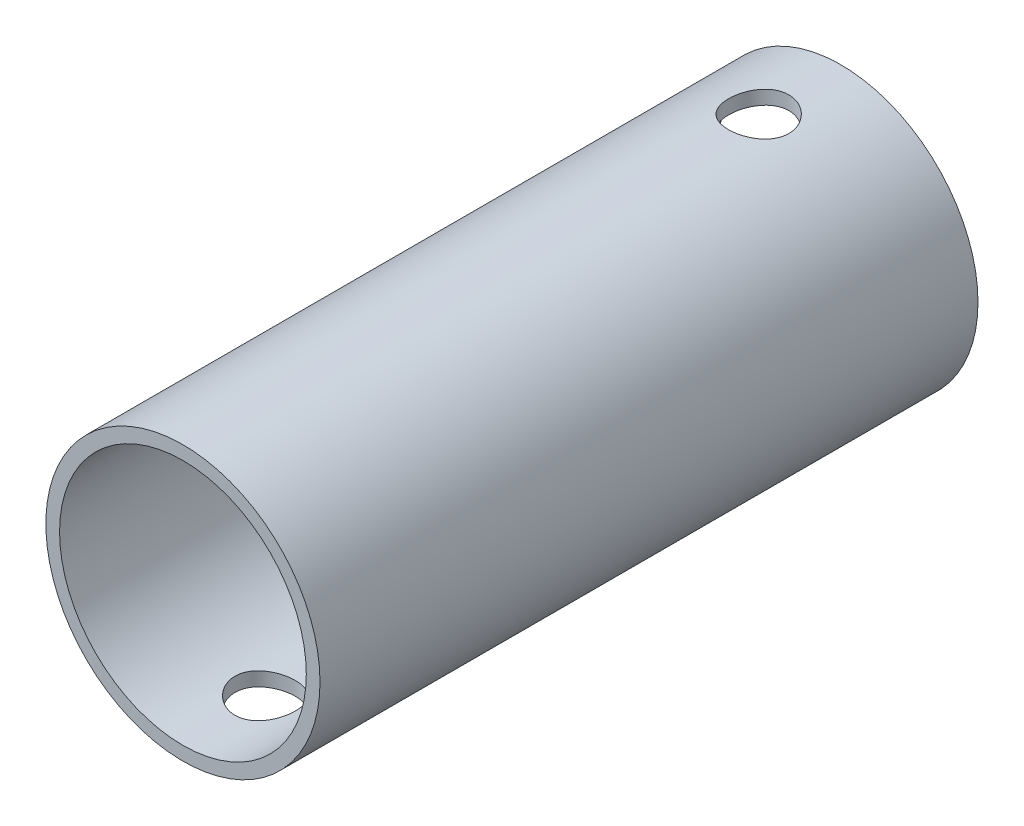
ISO-10303-21;
HEADER;
FILE_DESCRIPTION(('STEP AP214'),'2;1');
FILE_NAME('part.step','',(''),(''),'','','');
FILE_SCHEMA(('AUTOMOTIVE_DESIGN { 1 0 10303 214 1 1 1 1 }'));
ENDSEC;
DATA;
#1=APPLICATION_CONTEXT('core data for automotive mechanical design processes');
#2=APPLICATION_PROTOCOL_DEFINITION('international standard','automotive_design',2000,#1);
#3=PRODUCT_CONTEXT('',#1,'mechanical');
#4=PRODUCT('Part','Part','',(#3));
#5=PRODUCT_RELATED_PRODUCT_CATEGORY('part','',(#4));
#6=PRODUCT_DEFINITION_FORMATION('','',#4);
#7=PRODUCT_DEFINITION_CONTEXT('part definition',#1,'design');
#8=PRODUCT_DEFINITION('design','',#6,#7);
#9=PRODUCT_DEFINITION_SHAPE('','',#8);
#10=(LENGTH_UNIT() NAMED_UNIT(*) SI_UNIT(.MILLI.,.METRE.));
#11=(NAMED_UNIT(*) PLANE_ANGLE_UNIT() SI_UNIT($,.RADIAN.));
#12=(NAMED_UNIT(*) SI_UNIT($,.STERADIAN.) SOLID_ANGLE_UNIT());
#13=UNCERTAINTY_MEASURE_WITH_UNIT(LENGTH_MEASURE(1.E-05),#10,'distance_accuracy_value','');
#14=(GEOMETRIC_REPRESENTATION_CONTEXT(3) GLOBAL_UNCERTAINTY_ASSIGNED_CONTEXT((#13)) GLOBAL_UNIT_ASSIGNED_CONTEXT((#10,
#11,#12)) REPRESENTATION_CONTEXT('',''));
#15=CARTESIAN_POINT('',(0.,0.,0.));
#16=DIRECTION('',(0.,0.,1.));
#17=DIRECTION('',(1.,0.,0.));
#18=AXIS2_PLACEMENT_3D('',#15,#16,#17);
#19=CARTESIAN_POINT('',(0.,0.,1200.));
#20=DIRECTION('',(0.,0.,-1.));
#21=DIRECTION('',(-1.,0.,0.));
#22=AXIS2_PLACEMENT_3D('',#19,#20,#21);
#23=CYLINDRICAL_SURFACE('',#22,250.);
#24=CARTESIAN_POINT('',(0.,-250.,1105.));
#25=CARTESIAN_POINT('',(1.52516091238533,-249.99999609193,1104.99999226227));
#26=CARTESIAN_POINT('',(3.05048919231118,-249.986007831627,1104.93650652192));
#27=CARTESIAN_POINT('',(6.09022569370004,-249.93043251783,1104.68305072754));
#28=CARTESIAN_POINT('',(7.60463225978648,-249.888841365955,1104.49306189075));
#29=CARTESIAN_POINT('',(10.612476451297,-249.779185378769,1103.98798231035));
#30=CARTESIAN_POINT('',(12.105900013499,-249.711103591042,1103.67281145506));
#31=CARTESIAN_POINT('',(15.0600950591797,-249.55035968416,1102.91991208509));
#32=CARTESIAN_POINT('',(16.5208676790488,-249.457698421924,1102.48218784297));
#33=CARTESIAN_POINT('',(19.3981221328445,-249.250458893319,1101.48812606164));
#34=CARTESIAN_POINT('',(20.8146491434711,-249.1359038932,1100.93191436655));
#35=CARTESIAN_POINT('',(23.5953978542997,-248.887938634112,1099.7047972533));
#36=CARTESIAN_POINT('',(24.9596191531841,-248.754528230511,1099.03389095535));
#37=CARTESIAN_POINT('',(27.6265956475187,-248.472472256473,1097.58230858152));
#38=CARTESIAN_POINT('',(28.9293539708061,-248.323827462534,1096.80163809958));
#39=CARTESIAN_POINT('',(31.4649695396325,-248.015296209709,1095.13598035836));
#40=CARTESIAN_POINT('',(32.6978260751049,-247.855409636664,1094.25099203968));
#41=CARTESIAN_POINT('',(35.1030445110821,-247.526304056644,1092.36911205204));
#42=CARTESIAN_POINT('',(36.2742656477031,-247.356983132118,1091.37077992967));
#43=CARTESIAN_POINT('',(38.5287872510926,-247.015855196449,1089.27972085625));
#44=CARTESIAN_POINT('',(39.6120868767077,-246.844048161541,1088.18699300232));
#45=CARTESIAN_POINT('',(41.6836152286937,-246.502694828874,1085.91434854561));
#46=CARTESIAN_POINT('',(42.6718357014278,-246.333148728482,1084.73442438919));
#47=CARTESIAN_POINT('',(44.5463780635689,-246.001070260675,1082.29529430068));
#48=CARTESIAN_POINT('',(45.4326995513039,-245.838537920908,1081.03608805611));
#49=CARTESIAN_POINT('',(47.1065974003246,-245.523323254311,1078.43221287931));
#50=CARTESIAN_POINT('',(47.8929537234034,-245.370771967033,1077.08674331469));
#51=CARTESIAN_POINT('',(49.349313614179,-245.082020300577,1074.3325278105));
#52=CARTESIAN_POINT('',(50.0193160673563,-244.945820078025,1072.92378126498));
#53=CARTESIAN_POINT('',(51.237750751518,-244.693849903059,1070.05303131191));
#54=CARTESIAN_POINT('',(51.7861944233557,-244.578078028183,1068.59103293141));
#55=CARTESIAN_POINT('',(52.757196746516,-244.370466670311,1065.6241590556));
#56=CARTESIAN_POINT('',(53.1797576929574,-244.278626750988,1064.11928434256));
#57=CARTESIAN_POINT('',(53.889872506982,-244.122944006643,1061.10163736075));
#58=CARTESIAN_POINT('',(54.1794454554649,-244.058683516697,1059.5893616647));
#59=CARTESIAN_POINT('',(54.6308674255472,-243.958033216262,1056.54494373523));
#60=CARTESIAN_POINT('',(54.7927176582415,-243.9216431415,1055.01280169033));
#61=CARTESIAN_POINT('',(54.9873225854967,-243.877847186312,1051.94009440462));
#62=CARTESIAN_POINT('',(55.0200913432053,-243.870438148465,1050.39953009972));
#63=CARTESIAN_POINT('',(54.9562927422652,-243.884823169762,1047.32122803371));
#64=CARTESIAN_POINT('',(54.8597267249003,-243.906616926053,1045.78349024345));
#65=CARTESIAN_POINT('',(54.541056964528,-243.978070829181,1042.75050208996));
#66=CARTESIAN_POINT('',(54.3213050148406,-244.027208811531,1041.25499158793));
#67=CARTESIAN_POINT('',(53.7597689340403,-244.15153043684,1038.28818915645));
#68=CARTESIAN_POINT('',(53.4179865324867,-244.226713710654,1036.81689688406));
#69=CARTESIAN_POINT('',(52.6150593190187,-244.400949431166,1033.90865713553));
#70=CARTESIAN_POINT('',(52.1539098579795,-244.50000280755,1032.47171099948));
#71=CARTESIAN_POINT('',(51.1157643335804,-244.7191448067,1029.64195383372));
#72=CARTESIAN_POINT('',(50.5387668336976,-244.839233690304,1028.24914335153));
#73=CARTESIAN_POINT('',(49.2680803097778,-245.098102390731,1025.50592817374));
#74=CARTESIAN_POINT('',(48.5734914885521,-245.23702454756,1024.15595378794));
#75=CARTESIAN_POINT('',(47.0758998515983,-245.528901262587,1021.51915379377));
#76=CARTESIAN_POINT('',(46.272896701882,-245.681855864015,1020.23232837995));
#77=CARTESIAN_POINT('',(44.5639383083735,-245.997581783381,1017.73002655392));
#78=CARTESIAN_POINT('',(43.6579711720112,-246.160354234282,1016.51455840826));
#79=CARTESIAN_POINT('',(41.7492344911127,-246.491256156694,1014.16294004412));
#80=CARTESIAN_POINT('',(40.7464635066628,-246.659385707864,1013.02679100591));
#81=CARTESIAN_POINT('',(38.6277126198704,-247.000153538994,1010.81717666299));
#82=CARTESIAN_POINT('',(37.5097339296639,-247.172809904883,1009.74562977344));
#83=CARTESIAN_POINT('',(35.1870718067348,-247.514135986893,1007.70030045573));
#84=CARTESIAN_POINT('',(33.9823870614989,-247.682805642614,1006.72651950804));
#85=CARTESIAN_POINT('',(31.4943766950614,-248.011448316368,1004.88347309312));
#86=CARTESIAN_POINT('',(30.2110490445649,-248.171421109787,1004.0142103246));
#87=CARTESIAN_POINT('',(27.5744613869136,-248.478188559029,1002.38645856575));
#88=CARTESIAN_POINT('',(26.2212017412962,-248.62498328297,1001.62796900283));
#89=CARTESIAN_POINT('',(23.4509729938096,-248.901573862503,1000.22583866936));
#90=CARTESIAN_POINT('',(22.0338702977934,-249.031331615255,999.582454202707));
#91=CARTESIAN_POINT('',(19.1486852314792,-249.269779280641,998.417559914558));
#92=CARTESIAN_POINT('',(17.6806026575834,-249.378469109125,997.896050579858));
#93=CARTESIAN_POINT('',(14.7041934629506,-249.571653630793,996.979142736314));
#94=CARTESIAN_POINT('',(13.1958716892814,-249.65615122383,996.583729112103));
#95=CARTESIAN_POINT('',(10.1499048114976,-249.798526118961,995.922202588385));
#96=CARTESIAN_POINT('',(8.61226025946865,-249.856403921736,995.656087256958));
#97=CARTESIAN_POINT('',(5.55022873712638,-249.942980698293,995.259427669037));
#98=CARTESIAN_POINT('',(4.02619618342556,-249.972242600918,995.126266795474));
#99=CARTESIAN_POINT('',(0.972063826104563,-250.002774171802,994.987349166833));
#100=CARTESIAN_POINT('',(-0.558035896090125,-250.004044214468,994.981590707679));
#101=CARTESIAN_POINT('',(-3.61306072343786,-249.978557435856,995.097519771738));
#102=CARTESIAN_POINT('',(-5.1379861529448,-249.951802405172,995.219199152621));
#103=CARTESIAN_POINT('',(-8.17169117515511,-249.871018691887,995.588985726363));
#104=CARTESIAN_POINT('',(-9.68047081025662,-249.816990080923,995.837092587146));
#105=CARTESIAN_POINT('',(-12.6543762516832,-249.683915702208,996.454249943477));
#106=CARTESIAN_POINT('',(-14.1198010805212,-249.605155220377,996.821922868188));
#107=CARTESIAN_POINT('',(-17.0141301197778,-249.424581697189,997.67604716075));
#108=CARTESIAN_POINT('',(-18.4430346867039,-249.322768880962,998.162497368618));
#109=CARTESIAN_POINT('',(-21.2547530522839,-249.098825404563,999.250536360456));
#110=CARTESIAN_POINT('',(-22.6375639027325,-248.976693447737,999.852132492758));
#111=CARTESIAN_POINT('',(-25.3478580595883,-248.715379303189,1001.16605463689));
#112=CARTESIAN_POINT('',(-26.6753405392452,-248.576196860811,1001.87838230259));
#113=CARTESIAN_POINT('',(-29.285029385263,-248.282371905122,1003.41978314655));
#114=CARTESIAN_POINT('',(-30.5663077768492,-248.127535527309,1004.25039059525));
#115=CARTESIAN_POINT('',(-33.0546278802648,-247.808323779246,1006.01457418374));
#116=CARTESIAN_POINT('',(-34.2616689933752,-247.643948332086,1006.94815115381));
#117=CARTESIAN_POINT('',(-36.5937774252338,-247.31009570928,1008.91205022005));
#118=CARTESIAN_POINT('',(-37.7188352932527,-247.14061794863,1009.94238343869));
#119=CARTESIAN_POINT('',(-39.8794835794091,-246.801181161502,1012.09287511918));
#120=CARTESIAN_POINT('',(-40.9150730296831,-246.631222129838,1013.2130345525));
#121=CARTESIAN_POINT('',(-42.9084034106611,-246.292326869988,1015.55757821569));
#122=CARTESIAN_POINT('',(-43.8643280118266,-246.123469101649,1016.78351889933));
#123=CARTESIAN_POINT('',(-45.6695317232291,-245.794906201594,1019.31274129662));
#124=CARTESIAN_POINT('',(-46.5188093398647,-245.635201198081,1020.61602409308));
#125=CARTESIAN_POINT('',(-48.1045501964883,-245.329583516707,1023.29101886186));
#126=CARTESIAN_POINT('',(-48.841016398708,-245.183670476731,1024.66272903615));
#127=CARTESIAN_POINT('',(-50.1956284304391,-244.909935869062,1027.46511850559));
#128=CARTESIAN_POINT('',(-50.8137756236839,-244.782114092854,1028.89579712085));
#129=CARTESIAN_POINT('',(-51.9237531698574,-244.54906229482,1031.79771159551));
#130=CARTESIAN_POINT('',(-52.4162854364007,-244.443707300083,1033.26866884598));
#131=CARTESIAN_POINT('',(-53.275677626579,-244.257846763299,1036.24840242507));
#132=CARTESIAN_POINT('',(-53.6425377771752,-244.177341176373,1037.75717868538));
#133=CARTESIAN_POINT('',(-54.2475075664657,-244.043651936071,1040.80131680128));
#134=CARTESIAN_POINT('',(-54.4856347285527,-243.990464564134,1042.3366750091));
#135=CARTESIAN_POINT('',(-54.8311902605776,-243.913042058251,1045.42274598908));
#136=CARTESIAN_POINT('',(-54.9386209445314,-243.888806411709,1046.97345848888));
#137=CARTESIAN_POINT('',(-55.0209493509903,-243.870245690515,1050.04424823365));
#138=CARTESIAN_POINT('',(-54.9987233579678,-243.875271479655,1051.56424520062));
#139=CARTESIAN_POINT('',(-54.828601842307,-243.913574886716,1054.59681309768));
#140=CARTESIAN_POINT('',(-54.6807082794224,-243.946852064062,1056.10938414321));
#141=CARTESIAN_POINT('',(-54.2604703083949,-244.04066786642,1059.11623925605));
#142=CARTESIAN_POINT('',(-53.9881281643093,-244.101205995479,1060.61052365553));
#143=CARTESIAN_POINT('',(-53.3211867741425,-244.24775829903,1063.57027301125));
#144=CARTESIAN_POINT('',(-52.926586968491,-244.333772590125,1065.03573783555));
#145=CARTESIAN_POINT('',(-52.0198553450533,-244.528420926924,1067.92248230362));
#146=CARTESIAN_POINT('',(-51.5081496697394,-244.636972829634,1069.34390143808));
#147=CARTESIAN_POINT('',(-50.370285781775,-244.873787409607,1072.13843685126));
#148=CARTESIAN_POINT('',(-49.7441281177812,-245.00204999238,1073.51155336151));
#149=CARTESIAN_POINT('',(-48.3818431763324,-245.274702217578,1076.20055540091));
#150=CARTESIAN_POINT('',(-47.6457070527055,-245.419093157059,1077.51643631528));
#151=CARTESIAN_POINT('',(-46.0686364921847,-245.720013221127,1080.08236414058));
#152=CARTESIAN_POINT('',(-45.227700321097,-245.876542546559,1081.3324099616));
#153=CARTESIAN_POINT('',(-43.4284745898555,-246.20077148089,1083.78351431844));
#154=CARTESIAN_POINT('',(-42.4681368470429,-246.368634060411,1084.98304830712));
#155=CARTESIAN_POINT('',(-40.4507782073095,-246.707884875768,1087.2973330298));
#156=CARTESIAN_POINT('',(-39.3937558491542,-246.879273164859,1088.41208248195));
#157=CARTESIAN_POINT('',(-37.1898441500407,-247.220870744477,1090.54963109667));
#158=CARTESIAN_POINT('',(-36.0429343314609,-247.39107975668,1091.57240919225));
#159=CARTESIAN_POINT('',(-33.6670613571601,-247.725589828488,1093.51881539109));
#160=CARTESIAN_POINT('',(-32.4380986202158,-247.889890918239,1094.44244400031));
#161=CARTESIAN_POINT('',(-29.8895536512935,-248.210163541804,1096.19565047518));
#162=CARTESIAN_POINT('',(-28.5689909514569,-248.365996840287,1097.02382914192));
#163=CARTESIAN_POINT('',(-25.8609666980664,-248.662553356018,1098.56581313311));
#164=CARTESIAN_POINT('',(-24.4735017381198,-248.803275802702,1099.27961262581));
#165=CARTESIAN_POINT('',(-21.6425238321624,-249.065494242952,1100.58685915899));
#166=CARTESIAN_POINT('',(-20.1990538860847,-249.187004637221,1101.1803964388));
#167=CARTESIAN_POINT('',(-17.265502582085,-249.407426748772,1102.24303905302));
#168=CARTESIAN_POINT('',(-15.7754295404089,-249.506342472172,1102.71216644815));
#169=CARTESIAN_POINT('',(-13.1072415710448,-249.65887224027,1103.4288733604));
#170=CARTESIAN_POINT('',(-11.9363665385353,-249.717672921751,1103.70259450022));
#171=CARTESIAN_POINT('',(-9.57823095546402,-249.819234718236,1104.17289898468));
#172=CARTESIAN_POINT('',(-8.39096716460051,-249.861992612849,1104.36946684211));
#173=CARTESIAN_POINT('',(-6.00566646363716,-249.930701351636,1104.68435904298));
#174=CARTESIAN_POINT('',(-4.80762993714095,-249.956652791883,1104.80268616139));
#175=CARTESIAN_POINT('',(-2.40642957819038,-249.991301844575,1104.96050140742));
#176=CARTESIAN_POINT('',(-1.20326687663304,-250.000003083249,1105.00000610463));
#177=CARTESIAN_POINT('',(0.,-250.,1105.));
#178=B_SPLINE_CURVE_WITH_KNOTS('',3,(#24,#25,#26,#27,#28,#29,#30,#31,#32,#33,#34,#35,#36,#37,
#38,#39,#40,#41,#42,#43,#44,#45,#46,#47,#48,#49,#50,#51,#52,#53,#54,#55,#56,#57,#58,#59,#60,#61,
#62,#63,#64,#65,#66,#67,#68,#69,#70,#71,#72,#73,#74,#75,#76,#77,#78,#79,#80,#81,#82,#83,#84,#85,
#86,#87,#88,#89,#90,#91,#92,#93,#94,#95,#96,#97,#98,#99,#100,#101,#102,#103,#104,#105,#106,#107,
#108,#109,#110,#111,#112,#113,#114,#115,#116,#117,#118,#119,#120,#121,#122,#123,#124,#125,#126,
#127,#128,#129,#130,#131,#132,#133,#134,#135,#136,#137,#138,#139,#140,#141,#142,#143,#144,#145,
#146,#147,#148,#149,#150,#151,#152,#153,#154,#155,#156,#157,#158,#159,#160,#161,#162,#163,#164,
#165,#166,#167,#168,#169,#170,#171,#172,#173,#174,#175,#176,#177),.UNSPECIFIED.,.T.,.F.,(4,2,2,
2,2,2,2,2,2,2,2,2,2,2,2,2,2,2,2,2,2,2,2,2,2,2,2,2,2,2,2,2,2,2,2,2,2,2,2,2,2,2,2,2,2,2,2,2,2,2,2,
2,2,2,2,2,2,2,2,2,2,2,2,2,2,2,2,2,2,2,2,2,2,2,2,2,4),(0.,4.57439193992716,9.14946322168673,
13.7274671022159,18.3053114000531,22.8783176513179,27.4513589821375,32.0241673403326,
36.5970221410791,41.2363914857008,45.8758052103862,50.5156213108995,55.1554557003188,
59.8473701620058,64.5393295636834,69.230847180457,73.9222792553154,78.5399160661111,
83.1575090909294,87.7745990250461,92.3916410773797,96.9234003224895,101.455095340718,
105.986966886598,110.518894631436,115.087212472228,119.655544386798,124.224404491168,
128.793332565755,133.462349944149,138.131438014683,142.80064661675,147.469831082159,
152.149286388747,156.828760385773,161.507673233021,166.186498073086,170.771310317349,
175.356061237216,179.940519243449,184.524965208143,189.058359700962,193.591709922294,
198.125349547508,202.659056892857,207.258089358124,211.85715890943,216.456757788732,
221.056406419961,225.742006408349,230.427672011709,235.113214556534,239.798703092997,
244.457406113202,249.116100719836,253.774161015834,258.432138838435,262.987183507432,
267.54215714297,272.097047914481,276.651959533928,281.190552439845,285.729123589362,
290.268059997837,294.807071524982,299.438905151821,304.070808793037,308.703770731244,
313.336709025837,318.03067674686,322.724883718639,327.41555521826,332.105394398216,
335.714497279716,339.324324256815,342.934023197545,346.542963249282),.UNSPECIFIED.);
#179=CARTESIAN_POINT('',(0.,-250.,1105.));
#180=VERTEX_POINT('',#179);
#181=EDGE_CURVE('E63',#180,#180,#178,.T.);
#182=ORIENTED_EDGE('',*,*,#181,.T.);
#183=EDGE_LOOP('',(#182));
#184=FACE_BOUND('',#183,.T.);
#185=CARTESIAN_POINT('',(0.,0.,1200.));
#186=DIRECTION('',(0.,0.,1.));
#187=DIRECTION('',(1.,0.,0.));
#188=AXIS2_PLACEMENT_3D('',#185,#186,#187);
#189=CIRCLE('',#188,250.);
#190=CARTESIAN_POINT('',(250.,0.,1200.));
#191=VERTEX_POINT('',#190);
#192=EDGE_CURVE('E10',#191,#191,#189,.T.);
#193=ORIENTED_EDGE('',*,*,#192,.F.);
#194=EDGE_LOOP('',(#193));
#195=FACE_BOUND('',#194,.T.);
#196=CARTESIAN_POINT('',(0.,0.,0.));
#197=DIRECTION('',(0.,0.,1.));
#198=DIRECTION('',(1.,0.,0.));
#199=AXIS2_PLACEMENT_3D('',#196,#197,#198);
#200=CIRCLE('',#199,250.);
#201=CARTESIAN_POINT('',(250.,0.,0.));
#202=VERTEX_POINT('',#201);
#203=EDGE_CURVE('E47',#202,#202,#200,.T.);
#204=ORIENTED_EDGE('',*,*,#203,.T.);
#205=EDGE_LOOP('',(#204));
#206=FACE_BOUND('',#205,.T.);
#207=CARTESIAN_POINT('',(0.,250.,95.));
#208=CARTESIAN_POINT('',(-1.52516091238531,249.99999609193,95.000007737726));
#209=CARTESIAN_POINT('',(-3.05048919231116,249.986007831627,95.0634934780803));
#210=CARTESIAN_POINT('',(-6.09022569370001,249.93043251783,95.3169492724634));
#211=CARTESIAN_POINT('',(-7.60463225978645,249.888841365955,95.5069381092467));
#212=CARTESIAN_POINT('',(-10.612476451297,249.779185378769,96.0120176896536));
#213=CARTESIAN_POINT('',(-12.105900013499,249.711103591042,96.3271885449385));
#214=CARTESIAN_POINT('',(-15.0600950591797,249.55035968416,97.0800879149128));
#215=CARTESIAN_POINT('',(-16.5208676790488,249.457698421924,97.5178121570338));
#216=CARTESIAN_POINT('',(-19.3981221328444,249.250458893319,98.5118739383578));
#217=CARTESIAN_POINT('',(-20.8146491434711,249.1359038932,99.0680856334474));
#218=CARTESIAN_POINT('',(-23.5953978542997,248.887938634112,100.295202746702));
#219=CARTESIAN_POINT('',(-24.9596191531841,248.754528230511,100.966109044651));
#220=CARTESIAN_POINT('',(-27.6265956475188,248.472472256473,102.417691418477));
#221=CARTESIAN_POINT('',(-28.9293539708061,248.323827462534,103.198361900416));
#222=CARTESIAN_POINT('',(-31.4649695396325,248.015296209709,104.864019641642));
#223=CARTESIAN_POINT('',(-32.6978260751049,247.855409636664,105.749007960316));
#224=CARTESIAN_POINT('',(-35.1030445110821,247.526304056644,107.630887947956));
#225=CARTESIAN_POINT('',(-36.2742656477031,247.356983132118,108.629220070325));
#226=CARTESIAN_POINT('',(-38.5287872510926,247.015855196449,110.720279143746));
#227=CARTESIAN_POINT('',(-39.6120868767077,246.844048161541,111.813006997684));
#228=CARTESIAN_POINT('',(-41.6836152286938,246.502694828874,114.085651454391));
#229=CARTESIAN_POINT('',(-42.6718357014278,246.333148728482,115.265575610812));
#230=CARTESIAN_POINT('',(-44.546378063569,246.001070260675,117.704705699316));
#231=CARTESIAN_POINT('',(-45.4326995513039,245.838537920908,118.963911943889));
#232=CARTESIAN_POINT('',(-47.1065974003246,245.523323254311,121.567787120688));
#233=CARTESIAN_POINT('',(-47.8929537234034,245.370771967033,122.913256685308));
#234=CARTESIAN_POINT('',(-49.349313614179,245.082020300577,125.667472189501));
#235=CARTESIAN_POINT('',(-50.0193160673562,244.945820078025,127.076218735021));
#236=CARTESIAN_POINT('',(-51.237750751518,244.693849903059,129.946968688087));
#237=CARTESIAN_POINT('',(-51.7861944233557,244.578078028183,131.40896706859));
#238=CARTESIAN_POINT('',(-52.757196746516,244.370466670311,134.375840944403));
#239=CARTESIAN_POINT('',(-53.1797576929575,244.278626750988,135.880715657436));
#240=CARTESIAN_POINT('',(-53.889872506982,244.122944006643,138.898362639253));
#241=CARTESIAN_POINT('',(-54.1794454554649,244.058683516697,140.410638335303));
#242=CARTESIAN_POINT('',(-54.6308674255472,243.958033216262,143.455056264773));
#243=CARTESIAN_POINT('',(-54.7927176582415,243.9216431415,144.987198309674));
#244=CARTESIAN_POINT('',(-54.9873225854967,243.877847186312,148.059905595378));
#245=CARTESIAN_POINT('',(-55.0200913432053,243.870438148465,149.600469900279));
#246=CARTESIAN_POINT('',(-54.9562927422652,243.884823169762,152.678771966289));
#247=CARTESIAN_POINT('',(-54.8597267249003,243.906616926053,154.216509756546));
#248=CARTESIAN_POINT('',(-54.541056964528,243.978070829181,157.249497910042));
#249=CARTESIAN_POINT('',(-54.3213050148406,244.027208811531,158.745008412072));
#250=CARTESIAN_POINT('',(-53.7597689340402,244.15153043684,161.711810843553));
#251=CARTESIAN_POINT('',(-53.4179865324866,244.226713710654,163.183103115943));
#252=CARTESIAN_POINT('',(-52.6150593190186,244.400949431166,166.091342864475));
#253=CARTESIAN_POINT('',(-52.1539098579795,244.50000280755,167.528289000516));
#254=CARTESIAN_POINT('',(-51.1157643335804,244.7191448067,170.358046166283));
#255=CARTESIAN_POINT('',(-50.5387668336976,244.839233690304,171.750856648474));
#256=CARTESIAN_POINT('',(-49.2680803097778,245.098102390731,174.494071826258));
#257=CARTESIAN_POINT('',(-48.573491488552,245.23702454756,175.84404621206));
#258=CARTESIAN_POINT('',(-47.0758998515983,245.528901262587,178.480846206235));
#259=CARTESIAN_POINT('',(-46.272896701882,245.681855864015,179.76767162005));
#260=CARTESIAN_POINT('',(-44.5639383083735,245.997581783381,182.269973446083));
#261=CARTESIAN_POINT('',(-43.6579711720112,246.160354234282,183.485441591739));
#262=CARTESIAN_POINT('',(-41.7492344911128,246.491256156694,185.837059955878));
#263=CARTESIAN_POINT('',(-40.7464635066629,246.659385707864,186.973208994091));
#264=CARTESIAN_POINT('',(-38.6277126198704,247.000153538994,189.182823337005));
#265=CARTESIAN_POINT('',(-37.5097339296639,247.172809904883,190.254370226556));
#266=CARTESIAN_POINT('',(-35.1870718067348,247.514135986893,192.299699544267));
#267=CARTESIAN_POINT('',(-33.9823870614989,247.682805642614,193.273480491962));
#268=CARTESIAN_POINT('',(-31.4943766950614,248.011448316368,195.116526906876));
#269=CARTESIAN_POINT('',(-30.2110490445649,248.171421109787,195.985789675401));
#270=CARTESIAN_POINT('',(-27.5744613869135,248.478188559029,197.613541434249));
#271=CARTESIAN_POINT('',(-26.2212017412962,248.62498328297,198.372030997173));
#272=CARTESIAN_POINT('',(-23.4509729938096,248.901573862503,199.774161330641));
#273=CARTESIAN_POINT('',(-22.0338702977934,249.031331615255,200.417545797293));
#274=CARTESIAN_POINT('',(-19.1486852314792,249.269779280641,201.582440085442));
#275=CARTESIAN_POINT('',(-17.6806026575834,249.378469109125,202.103949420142));
#276=CARTESIAN_POINT('',(-14.7041934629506,249.571653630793,203.020857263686));
#277=CARTESIAN_POINT('',(-13.1958716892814,249.65615122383,203.416270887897));
#278=CARTESIAN_POINT('',(-10.1499048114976,249.798526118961,204.077797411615));
#279=CARTESIAN_POINT('',(-8.61226025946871,249.856403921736,204.343912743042));
#280=CARTESIAN_POINT('',(-5.55022873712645,249.942980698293,204.740572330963));
#281=CARTESIAN_POINT('',(-4.02619618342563,249.972242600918,204.873733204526));
#282=CARTESIAN_POINT('',(-0.972063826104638,250.002774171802,205.012650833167));
#283=CARTESIAN_POINT('',(0.558035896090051,250.004044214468,205.018409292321));
#284=CARTESIAN_POINT('',(3.6130607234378,249.978557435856,204.902480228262));
#285=CARTESIAN_POINT('',(5.13798615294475,249.951802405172,204.780800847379));
#286=CARTESIAN_POINT('',(8.17169117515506,249.871018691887,204.411014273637));
#287=CARTESIAN_POINT('',(9.68047081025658,249.816990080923,204.162907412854));
#288=CARTESIAN_POINT('',(12.6543762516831,249.683915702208,203.545750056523));
#289=CARTESIAN_POINT('',(14.1198010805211,249.605155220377,203.178077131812));
#290=CARTESIAN_POINT('',(17.0141301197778,249.424581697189,202.32395283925));
#291=CARTESIAN_POINT('',(18.4430346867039,249.322768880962,201.837502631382));
#292=CARTESIAN_POINT('',(21.2547530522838,249.098825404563,200.749463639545));
#293=CARTESIAN_POINT('',(22.6375639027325,248.976693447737,200.147867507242));
#294=CARTESIAN_POINT('',(25.3478580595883,248.715379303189,198.833945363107));
#295=CARTESIAN_POINT('',(26.6753405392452,248.576196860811,198.121617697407));
#296=CARTESIAN_POINT('',(29.2850293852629,248.282371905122,196.580216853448));
#297=CARTESIAN_POINT('',(30.5663077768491,248.127535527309,195.749609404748));
#298=CARTESIAN_POINT('',(33.0546278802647,247.808323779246,193.985425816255));
#299=CARTESIAN_POINT('',(34.2616689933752,247.643948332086,193.05184884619));
#300=CARTESIAN_POINT('',(36.5937774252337,247.31009570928,191.087949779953));
#301=CARTESIAN_POINT('',(37.7188352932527,247.14061794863,190.057616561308));
#302=CARTESIAN_POINT('',(39.879483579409,246.801181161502,187.907124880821));
#303=CARTESIAN_POINT('',(40.9150730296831,246.631222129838,186.786965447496));
#304=CARTESIAN_POINT('',(42.9084034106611,246.292326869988,184.442421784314));
#305=CARTESIAN_POINT('',(43.8643280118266,246.123469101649,183.216481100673));
#306=CARTESIAN_POINT('',(45.6695317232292,245.794906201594,180.68725870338));
#307=CARTESIAN_POINT('',(46.5188093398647,245.635201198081,179.38397590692));
#308=CARTESIAN_POINT('',(48.1045501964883,245.329583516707,176.708981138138));
#309=CARTESIAN_POINT('',(48.841016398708,245.183670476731,175.337270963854));
#310=CARTESIAN_POINT('',(50.1956284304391,244.909935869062,172.53488149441));
#311=CARTESIAN_POINT('',(50.8137756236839,244.782114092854,171.104202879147));
#312=CARTESIAN_POINT('',(51.9237531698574,244.54906229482,168.202288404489));
#313=CARTESIAN_POINT('',(52.4162854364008,244.443707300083,166.731331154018));
#314=CARTESIAN_POINT('',(53.275677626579,244.257846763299,163.75159757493));
#315=CARTESIAN_POINT('',(53.6425377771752,244.177341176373,162.242821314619));
#316=CARTESIAN_POINT('',(54.2475075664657,244.043651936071,159.198683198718));
#317=CARTESIAN_POINT('',(54.4856347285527,243.990464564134,157.663324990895));
#318=CARTESIAN_POINT('',(54.8311902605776,243.913042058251,154.577254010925));
#319=CARTESIAN_POINT('',(54.9386209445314,243.888806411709,153.026541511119));
#320=CARTESIAN_POINT('',(55.0209493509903,243.870245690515,149.955751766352));
#321=CARTESIAN_POINT('',(54.9987233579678,243.875271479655,148.435754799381));
#322=CARTESIAN_POINT('',(54.828601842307,243.913574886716,145.403186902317));
#323=CARTESIAN_POINT('',(54.6807082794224,243.946852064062,143.890615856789));
#324=CARTESIAN_POINT('',(54.2604703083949,244.04066786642,140.883760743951));
#325=CARTESIAN_POINT('',(53.9881281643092,244.10120599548,139.389476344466));
#326=CARTESIAN_POINT('',(53.3211867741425,244.24775829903,136.429726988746));
#327=CARTESIAN_POINT('',(52.926586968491,244.333772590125,134.964262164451));
#328=CARTESIAN_POINT('',(52.0198553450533,244.528420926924,132.077517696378));
#329=CARTESIAN_POINT('',(51.5081496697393,244.636972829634,130.656098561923));
#330=CARTESIAN_POINT('',(50.370285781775,244.873787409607,127.861563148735));
#331=CARTESIAN_POINT('',(49.7441281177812,245.00204999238,126.488446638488));
#332=CARTESIAN_POINT('',(48.3818431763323,245.274702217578,123.799444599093));
#333=CARTESIAN_POINT('',(47.6457070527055,245.419093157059,122.483563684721));
#334=CARTESIAN_POINT('',(46.0686364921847,245.720013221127,119.917635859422));
#335=CARTESIAN_POINT('',(45.2277003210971,245.876542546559,118.667590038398));
#336=CARTESIAN_POINT('',(43.4284745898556,246.20077148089,116.216485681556));
#337=CARTESIAN_POINT('',(42.468136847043,246.368634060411,115.016951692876));
#338=CARTESIAN_POINT('',(40.4507782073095,246.707884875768,112.702666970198));
#339=CARTESIAN_POINT('',(39.3937558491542,246.879273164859,111.587917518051));
#340=CARTESIAN_POINT('',(37.1898441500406,247.220870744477,109.450368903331));
#341=CARTESIAN_POINT('',(36.0429343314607,247.39107975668,108.427590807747));
#342=CARTESIAN_POINT('',(33.66706135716,247.725589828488,106.481184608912));
#343=CARTESIAN_POINT('',(32.4380986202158,247.889890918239,105.55755599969));
#344=CARTESIAN_POINT('',(29.8895536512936,248.210163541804,103.804349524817));
#345=CARTESIAN_POINT('',(28.568990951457,248.365996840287,102.97617085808));
#346=CARTESIAN_POINT('',(25.8609666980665,248.662553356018,101.434186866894));
#347=CARTESIAN_POINT('',(24.4735017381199,248.803275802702,100.720387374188));
#348=CARTESIAN_POINT('',(21.6425238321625,249.065494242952,99.4131408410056));
#349=CARTESIAN_POINT('',(20.1990538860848,249.187004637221,98.8196035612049));
#350=CARTESIAN_POINT('',(17.265502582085,249.407426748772,97.7569609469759));
#351=CARTESIAN_POINT('',(15.7754295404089,249.506342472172,97.2878335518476));
#352=CARTESIAN_POINT('',(13.1072415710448,249.65887224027,96.571126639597));
#353=CARTESIAN_POINT('',(11.9363665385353,249.717672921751,96.297405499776));
#354=CARTESIAN_POINT('',(9.57823095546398,249.819234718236,95.827101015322));
#355=CARTESIAN_POINT('',(8.3909671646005,249.861992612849,95.6305331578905));
#356=CARTESIAN_POINT('',(6.00566646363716,249.930701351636,95.3156409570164));
#357=CARTESIAN_POINT('',(4.80762993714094,249.956652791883,95.1973138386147));
#358=CARTESIAN_POINT('',(2.40642957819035,249.991301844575,95.039498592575));
#359=CARTESIAN_POINT('',(1.20326687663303,250.000003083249,94.9999938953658));
#360=CARTESIAN_POINT('',(0.,250.,95.));
#361=B_SPLINE_CURVE_WITH_KNOTS('',3,(#207,#208,#209,#210,#211,#212,#213,#214,#215,#216,#217,
#218,#219,#220,#221,#222,#223,#224,#225,#226,#227,#228,#229,#230,#231,#232,#233,#234,#235,#236,
#237,#238,#239,#240,#241,#242,#243,#244,#245,#246,#247,#248,#249,#250,#251,#252,#253,#254,#255,
#256,#257,#258,#259,#260,#261,#262,#263,#264,#265,#266,#267,#268,#269,#270,#271,#272,#273,#274,
#275,#276,#277,#278,#279,#280,#281,#282,#283,#284,#285,#286,#287,#288,#289,#290,#291,#292,#293,
#294,#295,#296,#297,#298,#299,#300,#301,#302,#303,#304,#305,#306,#307,#308,#309,#310,#311,#312,
#313,#314,#315,#316,#317,#318,#319,#320,#321,#322,#323,#324,#325,#326,#327,#328,#329,#330,#331,
#332,#333,#334,#335,#336,#337,#338,#339,#340,#341,#342,#343,#344,#345,#346,#347,#348,#349,#350,
#351,#352,#353,#354,#355,#356,#357,#358,#359,#360),.UNSPECIFIED.,.T.,.F.,(4,2,2,2,2,2,2,2,2,2,2,
2,2,2,2,2,2,2,2,2,2,2,2,2,2,2,2,2,2,2,2,2,2,2,2,2,2,2,2,2,2,2,2,2,2,2,2,2,2,2,2,2,2,2,2,2,2,2,2,
2,2,2,2,2,2,2,2,2,2,2,2,2,2,2,2,2,4),(0.,4.57439193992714,9.1494632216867,13.7274671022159,
18.3053114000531,22.8783176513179,27.4513589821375,32.0241673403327,36.5970221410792,
41.2363914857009,45.8758052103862,50.5156213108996,55.1554557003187,59.8473701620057,
64.5393295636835,69.230847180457,73.9222792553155,78.5399160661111,83.1575090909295,
87.7745990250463,92.3916410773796,96.9234003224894,101.455095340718,105.986966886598,
110.518894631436,115.087212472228,119.655544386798,124.224404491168,128.793332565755,
133.462349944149,138.131438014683,142.80064661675,147.469831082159,152.149286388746,
156.828760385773,161.507673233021,166.186498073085,170.771310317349,175.356061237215,
179.940519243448,184.524965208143,189.058359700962,193.591709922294,198.125349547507,
202.659056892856,207.258089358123,211.85715890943,216.456757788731,221.056406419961,
225.742006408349,230.427672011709,235.113214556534,239.798703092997,244.457406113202,
249.116100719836,253.774161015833,258.432138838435,262.987183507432,267.54215714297,
272.09704791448,276.651959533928,281.190552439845,285.729123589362,290.268059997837,
294.807071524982,299.438905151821,304.070808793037,308.703770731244,313.336709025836,
318.030676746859,322.724883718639,327.41555521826,332.105394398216,335.714497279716,
339.324324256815,342.934023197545,346.542963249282),.UNSPECIFIED.);
#362=CARTESIAN_POINT('',(0.,250.,95.));
#363=VERTEX_POINT('',#362);
#364=EDGE_CURVE('E62',#363,#363,#361,.T.);
#365=ORIENTED_EDGE('',*,*,#364,.F.);
#366=EDGE_LOOP('',(#365));
#367=FACE_BOUND('',#366,.T.);
#368=ADVANCED_FACE('F35',(#184,#195,#206,#367),#23,.T.);
#369=CARTESIAN_POINT('',(0.,0.,1200.));
#370=DIRECTION('',(0.,0.,-1.));
#371=DIRECTION('',(-1.,0.,0.));
#372=AXIS2_PLACEMENT_3D('',#369,#370,#371);
#373=CYLINDRICAL_SURFACE('',#372,225.);
#374=CARTESIAN_POINT('',(0.,-225.,1105.));
#375=CARTESIAN_POINT('',(1.52061605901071,-224.999996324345,1104.99999331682));
#376=CARTESIAN_POINT('',(3.04136825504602,-224.984546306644,1104.93688470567));
#377=CARTESIAN_POINT('',(6.0719081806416,-224.92316444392,1104.68495706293));
#378=CARTESIAN_POINT('',(7.58169456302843,-224.877228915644,1104.49612284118));
#379=CARTESIAN_POINT('',(10.5801123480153,-224.756120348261,1103.99419364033));
#380=CARTESIAN_POINT('',(12.0687320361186,-224.680931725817,1103.68103242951));
#381=CARTESIAN_POINT('',(15.0133568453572,-224.503396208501,1102.93304010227));
#382=CARTESIAN_POINT('',(16.4693628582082,-224.40105005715,1102.49821231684));
#383=CARTESIAN_POINT('',(19.3370085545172,-224.172136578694,1101.51094001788));
#384=CARTESIAN_POINT('',(20.7486987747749,-224.045598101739,1100.95863551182));
#385=CARTESIAN_POINT('',(23.5200127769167,-223.771642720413,1099.74032762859));
#386=CARTESIAN_POINT('',(24.8796362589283,-223.624225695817,1099.07432359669));
#387=CARTESIAN_POINT('',(27.5378794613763,-223.312463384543,1097.63350465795));
#388=CARTESIAN_POINT('',(28.836499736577,-223.148118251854,1096.85869074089));
#389=CARTESIAN_POINT('',(31.3644328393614,-222.80686570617,1095.20567650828));
#390=CARTESIAN_POINT('',(32.5937447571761,-222.629958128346,1094.3274748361));
#391=CARTESIAN_POINT('',(34.9964188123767,-222.265052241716,1092.45714651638));
#392=CARTESIAN_POINT('',(36.1684021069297,-222.076912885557,1091.4632756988));
#393=CARTESIAN_POINT('',(38.4248929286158,-221.697624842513,1089.38126855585));
#394=CARTESIAN_POINT('',(39.5093994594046,-221.506476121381,1088.29313115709));
#395=CARTESIAN_POINT('',(41.5839133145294,-221.126413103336,1086.02964209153));
#396=CARTESIAN_POINT('',(42.5739108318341,-220.937499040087,1084.85428139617));
#397=CARTESIAN_POINT('',(44.4526306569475,-220.567179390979,1082.42410351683));
#398=CARTESIAN_POINT('',(45.3413524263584,-220.385773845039,1081.1692859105));
#399=CARTESIAN_POINT('',(47.02318575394,-220.033108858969,1078.57008601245));
#400=CARTESIAN_POINT('',(47.8147645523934,-219.862029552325,1077.22468675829));
#401=CARTESIAN_POINT('',(49.2815090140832,-219.537917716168,1074.46973904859));
#402=CARTESIAN_POINT('',(49.9566732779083,-219.384885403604,1073.06018982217));
#403=CARTESIAN_POINT('',(51.1852290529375,-219.101506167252,1070.18695566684));
#404=CARTESIAN_POINT('',(51.7386349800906,-218.971156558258,1068.72327717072));
#405=CARTESIAN_POINT('',(52.719224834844,-218.737143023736,1065.75215644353));
#406=CARTESIAN_POINT('',(53.1464116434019,-218.633478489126,1064.24471521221));
#407=CARTESIAN_POINT('',(53.8639571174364,-218.457794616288,1061.22648186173));
#408=CARTESIAN_POINT('',(54.1567856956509,-218.385205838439,1059.71630993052));
#409=CARTESIAN_POINT('',(54.6150195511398,-218.27105987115,1056.67559000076));
#410=CARTESIAN_POINT('',(54.7804263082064,-218.229502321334,1055.14504223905));
#411=CARTESIAN_POINT('',(54.9823586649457,-218.178713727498,1052.07514023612));
#412=CARTESIAN_POINT('',(55.0189017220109,-218.169478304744,1050.53578721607));
#413=CARTESIAN_POINT('',(54.9628309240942,-218.18361092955,1047.45959706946));
#414=CARTESIAN_POINT('',(54.870218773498,-218.206978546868,1045.92275990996));
#415=CARTESIAN_POINT('',(54.5602927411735,-218.284674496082,1042.89849204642));
#416=CARTESIAN_POINT('',(54.345912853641,-218.338274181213,1041.41074079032));
#417=CARTESIAN_POINT('',(53.7964718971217,-218.474299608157,1038.45906744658));
#418=CARTESIAN_POINT('',(53.4614129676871,-218.556724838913,1036.99514493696));
#419=CARTESIAN_POINT('',(52.6732893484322,-218.748002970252,1034.10113619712));
#420=CARTESIAN_POINT('',(52.2202191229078,-218.856857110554,1032.67105155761));
#421=CARTESIAN_POINT('',(51.1995855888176,-219.097871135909,1029.8543704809));
#422=CARTESIAN_POINT('',(50.6320205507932,-219.230031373,1028.46777470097));
#423=CARTESIAN_POINT('',(49.3805690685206,-219.515318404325,1025.73394882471));
#424=CARTESIAN_POINT('',(48.6956090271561,-219.668635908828,1024.38723021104));
#425=CARTESIAN_POINT('',(47.2181989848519,-219.990938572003,1021.75609487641));
#426=CARTESIAN_POINT('',(46.4257485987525,-220.159923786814,1020.47167837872));
#427=CARTESIAN_POINT('',(44.7386999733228,-220.508935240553,1017.97311618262));
#428=CARTESIAN_POINT('',(43.8440874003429,-220.68896302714,1016.75898038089));
#429=CARTESIAN_POINT('',(41.9587259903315,-221.05516790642,1014.40877997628));
#430=CARTESIAN_POINT('',(40.967975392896,-221.241345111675,1013.27271680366));
#431=CARTESIAN_POINT('',(38.8684707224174,-221.619968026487,1011.05599703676));
#432=CARTESIAN_POINT('',(37.7572373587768,-221.812446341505,1009.97769275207));
#433=CARTESIAN_POINT('',(35.4474267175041,-222.193271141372,1007.91824427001));
#434=CARTESIAN_POINT('',(34.2488478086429,-222.381617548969,1006.93710188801));
#435=CARTESIAN_POINT('',(31.7722404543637,-222.748942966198,1005.07871825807));
#436=CARTESIAN_POINT('',(30.4942091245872,-222.927921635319,1004.20148078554));
#437=CARTESIAN_POINT('',(27.8672645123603,-223.271516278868,1002.55722795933));
#438=CARTESIAN_POINT('',(26.5183516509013,-223.436132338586,1001.7902119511));
#439=CARTESIAN_POINT('',(23.7543653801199,-223.746888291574,1000.36984760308));
#440=CARTESIAN_POINT('',(22.3390941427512,-223.89296740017,999.716870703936));
#441=CARTESIAN_POINT('',(19.4563081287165,-224.161877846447,998.53272709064));
#442=CARTESIAN_POINT('',(17.9887930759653,-224.284709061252,998.001561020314));
#443=CARTESIAN_POINT('',(15.0123084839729,-224.503578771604,997.065473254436));
#444=CARTESIAN_POINT('',(13.5033451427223,-224.599621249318,996.6605327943));
#445=CARTESIAN_POINT('',(10.4549245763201,-224.762149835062,995.980250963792));
#446=CARTESIAN_POINT('',(8.91546806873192,-224.828636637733,995.704906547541));
#447=CARTESIAN_POINT('',(5.85572348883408,-224.92886840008,995.291362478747));
#448=CARTESIAN_POINT('',(4.33589225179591,-224.963376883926,995.149962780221));
#449=CARTESIAN_POINT('',(1.28935876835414,-225.001462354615,994.993965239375));
#450=CARTESIAN_POINT('',(-0.237343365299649,-225.00503984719,994.979365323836));
#451=CARTESIAN_POINT('',(-3.28630807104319,-224.981164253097,995.077086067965));
#452=CARTESIAN_POINT('',(-4.80857098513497,-224.95371362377,995.189396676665));
#453=CARTESIAN_POINT('',(-7.83765932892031,-224.868554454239,995.539962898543));
#454=CARTESIAN_POINT('',(-9.34448481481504,-224.81084602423,995.778218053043));
#455=CARTESIAN_POINT('',(-12.3107189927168,-224.667799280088,996.374424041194));
#456=CARTESIAN_POINT('',(-13.7704967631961,-224.582862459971,996.730637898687));
#457=CARTESIAN_POINT('',(-16.6544295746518,-224.387430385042,997.560687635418));
#458=CARTESIAN_POINT('',(-18.0785850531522,-224.276935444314,998.034522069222));
#459=CARTESIAN_POINT('',(-20.8818356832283,-224.033320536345,999.096213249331));
#460=CARTESIAN_POINT('',(-22.2609275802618,-223.90019893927,999.684078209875));
#461=CARTESIAN_POINT('',(-24.9649573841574,-223.614846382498,1000.9694785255));
#462=CARTESIAN_POINT('',(-26.2898943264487,-223.46261508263,1001.66701583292));
#463=CARTESIAN_POINT('',(-28.8993248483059,-223.140285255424,1003.179682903));
#464=CARTESIAN_POINT('',(-30.1827377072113,-222.969925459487,1003.9966214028));
#465=CARTESIAN_POINT('',(-32.6765100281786,-222.618129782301,1005.73314555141));
#466=CARTESIAN_POINT('',(-33.8868688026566,-222.436693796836,1006.65273216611));
#467=CARTESIAN_POINT('',(-36.2269766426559,-222.067579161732,1008.58850028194));
#468=CARTESIAN_POINT('',(-37.3567141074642,-221.879899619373,1009.60469563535));
#469=CARTESIAN_POINT('',(-39.5281849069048,-221.503357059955,1011.72693522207));
#470=CARTESIAN_POINT('',(-40.5699170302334,-221.314494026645,1012.83298069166));
#471=CARTESIAN_POINT('',(-42.5819413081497,-220.936304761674,1015.15473067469));
#472=CARTESIAN_POINT('',(-43.5499888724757,-220.74707127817,1016.37239677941));
#473=CARTESIAN_POINT('',(-45.3801226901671,-220.37812099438,1018.88630838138));
#474=CARTESIAN_POINT('',(-46.2422070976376,-220.198404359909,1020.18255524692));
#475=CARTESIAN_POINT('',(-47.8541654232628,-219.853720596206,1022.84488400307));
#476=CARTESIAN_POINT('',(-48.6040420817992,-219.688753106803,1024.21096418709));
#477=CARTESIAN_POINT('',(-49.9859410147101,-219.378457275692,1027.0036360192));
#478=CARTESIAN_POINT('',(-50.6179648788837,-219.233128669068,1028.4302268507));
#479=CARTESIAN_POINT('',(-51.755741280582,-218.967309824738,1031.32521606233));
#480=CARTESIAN_POINT('',(-52.2622281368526,-218.846675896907,1032.79331251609));
#481=CARTESIAN_POINT('',(-53.1496707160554,-218.632845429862,1035.76894614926));
#482=CARTESIAN_POINT('',(-53.5306266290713,-218.539648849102,1037.27648326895));
#483=CARTESIAN_POINT('',(-54.1636962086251,-218.383608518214,1040.31965928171));
#484=CARTESIAN_POINT('',(-54.4158322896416,-218.320759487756,1041.85529323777));
#485=CARTESIAN_POINT('',(-54.7891333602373,-218.227377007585,1044.94336298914));
#486=CARTESIAN_POINT('',(-54.9103013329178,-218.196842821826,1046.49579840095));
#487=CARTESIAN_POINT('',(-55.0190764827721,-218.169438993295,1049.56291886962));
#488=CARTESIAN_POINT('',(-55.0102590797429,-218.171668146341,1051.07747023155));
#489=CARTESIAN_POINT('',(-54.8678130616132,-218.207535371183,1054.10029593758));
#490=CARTESIAN_POINT('',(-54.7341868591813,-218.241172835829,1055.60857040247));
#491=CARTESIAN_POINT('',(-54.343264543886,-218.338842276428,1058.60795503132));
#492=CARTESIAN_POINT('',(-54.0859715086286,-218.402873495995,1060.0990656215));
#493=CARTESIAN_POINT('',(-53.449855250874,-218.559420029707,1063.05360081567));
#494=CARTESIAN_POINT('',(-53.0710314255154,-218.651935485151,1064.5170252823));
#495=CARTESIAN_POINT('',(-52.1973068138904,-218.862152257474,1067.39812835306));
#496=CARTESIAN_POINT('',(-51.7030523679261,-218.979713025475,1068.81601341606));
#497=CARTESIAN_POINT('',(-50.6011487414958,-219.236957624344,1071.60490239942));
#498=CARTESIAN_POINT('',(-49.9935003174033,-219.376641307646,1072.97590663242));
#499=CARTESIAN_POINT('',(-48.6691830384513,-219.674238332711,1075.66229762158));
#500=CARTESIAN_POINT('',(-47.9525030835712,-219.832153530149,1076.97767869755));
#501=CARTESIAN_POINT('',(-46.4151657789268,-220.161872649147,1079.54437959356));
#502=CARTESIAN_POINT('',(-45.5945063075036,-220.333676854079,1080.79569810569));
#503=CARTESIAN_POINT('',(-43.8329218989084,-220.690965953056,1083.25690901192));
#504=CARTESIAN_POINT('',(-42.8895023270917,-220.87668554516,1084.46498248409));
#505=CARTESIAN_POINT('',(-40.9055600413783,-221.25269316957,1086.79782354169));
#506=CARTESIAN_POINT('',(-39.8650356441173,-221.44298128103,1087.92258968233));
#507=CARTESIAN_POINT('',(-37.6934942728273,-221.822937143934,1090.08173351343));
#508=CARTESIAN_POINT('',(-36.5624565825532,-222.012604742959,1091.11609039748));
#509=CARTESIAN_POINT('',(-34.2174555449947,-222.386094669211,1093.08725893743));
#510=CARTESIAN_POINT('',(-33.0034923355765,-222.569917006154,1094.02407075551));
#511=CARTESIAN_POINT('',(-30.4790516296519,-222.929765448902,1095.80892595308));
#512=CARTESIAN_POINT('',(-29.1672771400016,-223.105604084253,1096.6551739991));
#513=CARTESIAN_POINT('',(-26.4749124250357,-223.441086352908,1098.23395467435));
#514=CARTESIAN_POINT('',(-25.0943189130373,-223.600729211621,1098.96648186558));
#515=CARTESIAN_POINT('',(-22.2748987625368,-223.899167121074,1100.31169910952));
#516=CARTESIAN_POINT('',(-20.8361113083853,-224.037975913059,1100.92446823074));
#517=CARTESIAN_POINT('',(-17.9097858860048,-224.290871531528,1102.02578893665));
#518=CARTESIAN_POINT('',(-16.4222555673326,-224.404962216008,1102.51435990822));
#519=CARTESIAN_POINT('',(-13.7057399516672,-224.585451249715,1103.27977167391));
#520=CARTESIAN_POINT('',(-12.4834348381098,-224.656816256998,1103.57935547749));
#521=CARTESIAN_POINT('',(-10.0203412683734,-224.780142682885,1104.09413272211));
#522=CARTESIAN_POINT('',(-8.77955555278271,-224.832106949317,1104.30933854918));
#523=CARTESIAN_POINT('',(-6.28553385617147,-224.915647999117,1104.6541557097));
#524=CARTESIAN_POINT('',(-5.03229857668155,-224.947225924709,1104.78377183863));
#525=CARTESIAN_POINT('',(-2.51940724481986,-224.989404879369,1104.9567026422));
#526=CARTESIAN_POINT('',(-1.25975033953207,-225.000003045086,1105.00000553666));
#527=CARTESIAN_POINT('',(0.,-225.,1105.));
#528=B_SPLINE_CURVE_WITH_KNOTS('',3,(#374,#375,#376,#377,#378,#379,#380,#381,#382,#383,#384,
#385,#386,#387,#388,#389,#390,#391,#392,#393,#394,#395,#396,#397,#398,#399,#400,#401,#402,#403,
#404,#405,#406,#407,#408,#409,#410,#411,#412,#413,#414,#415,#416,#417,#418,#419,#420,#421,#422,
#423,#424,#425,#426,#427,#428,#429,#430,#431,#432,#433,#434,#435,#436,#437,#438,#439,#440,#441,
#442,#443,#444,#445,#446,#447,#448,#449,#450,#451,#452,#453,#454,#455,#456,#457,#458,#459,#460,
#461,#462,#463,#464,#465,#466,#467,#468,#469,#470,#471,#472,#473,#474,#475,#476,#477,#478,#479,
#480,#481,#482,#483,#484,#485,#486,#487,#488,#489,#490,#491,#492,#493,#494,#495,#496,#497,#498,
#499,#500,#501,#502,#503,#504,#505,#506,#507,#508,#509,#510,#511,#512,#513,#514,#515,#516,#517,
#518,#519,#520,#521,#522,#523,#524,#525,#526,#527),.UNSPECIFIED.,.T.,.F.,(4,2,2,2,2,2,2,2,2,2,2,
2,2,2,2,2,2,2,2,2,2,2,2,2,2,2,2,2,2,2,2,2,2,2,2,2,2,2,2,2,2,2,2,2,2,2,2,2,2,2,2,2,2,2,2,2,2,2,2,
2,2,2,2,2,2,2,2,2,2,2,2,2,2,2,2,2,4),(0.,4.56070112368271,9.12195337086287,13.6856387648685,
18.2491992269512,22.8073510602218,27.3655291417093,31.9236657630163,36.4818622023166,
41.1208944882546,45.759979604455,50.3995455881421,55.0391362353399,59.744451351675,
64.4498230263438,69.1546372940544,73.8593441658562,78.4737093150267,83.0880208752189,
87.701707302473,92.3153328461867,96.8222417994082,101.329070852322,105.836111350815,
110.343219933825,114.893991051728,119.444778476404,123.996205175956,128.547715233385,
133.223210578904,137.898793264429,142.574545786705,147.250270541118,151.940951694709,
156.631657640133,161.321665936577,166.011563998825,170.586359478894,175.161080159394,
179.735438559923,184.309780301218,188.819555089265,193.329274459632,197.839318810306,
202.3494434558,206.936781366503,211.524162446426,216.112202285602,220.700305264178,
225.39586466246,230.091505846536,234.787032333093,239.482495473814,244.149807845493,
248.817113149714,253.483606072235,258.149992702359,262.688269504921,267.226458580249,
271.764534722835,276.302633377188,280.815906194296,285.329148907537,289.842851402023,
294.356646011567,298.983337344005,303.610108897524,308.237942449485,312.865768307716,
317.572862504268,322.280181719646,326.98438241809,331.687848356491,335.466400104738,
339.244396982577,343.022182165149,346.800482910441),.UNSPECIFIED.);
#529=CARTESIAN_POINT('',(0.,-225.,1105.));
#530=VERTEX_POINT('',#529);
#531=EDGE_CURVE('E39',#530,#530,#528,.T.);
#532=ORIENTED_EDGE('',*,*,#531,.F.);
#533=EDGE_LOOP('',(#532));
#534=FACE_BOUND('',#533,.T.);
#535=CARTESIAN_POINT('',(0.,0.,0.));
#536=DIRECTION('',(0.,0.,1.));
#537=DIRECTION('',(1.,0.,0.));
#538=AXIS2_PLACEMENT_3D('',#535,#536,#537);
#539=CIRCLE('',#538,225.);
#540=CARTESIAN_POINT('',(225.,0.,0.));
#541=VERTEX_POINT('',#540);
#542=EDGE_CURVE('E55',#541,#541,#539,.T.);
#543=ORIENTED_EDGE('',*,*,#542,.F.);
#544=EDGE_LOOP('',(#543));
#545=FACE_BOUND('',#544,.T.);
#546=CARTESIAN_POINT('',(0.,0.,1200.));
#547=DIRECTION('',(0.,0.,1.));
#548=DIRECTION('',(1.,0.,0.));
#549=AXIS2_PLACEMENT_3D('',#546,#547,#548);
#550=CIRCLE('',#549,225.);
#551=CARTESIAN_POINT('',(225.,0.,1200.));
#552=VERTEX_POINT('',#551);
#553=EDGE_CURVE('E52',#552,#552,#550,.T.);
#554=ORIENTED_EDGE('',*,*,#553,.T.);
#555=EDGE_LOOP('',(#554));
#556=FACE_BOUND('',#555,.T.);
#557=CARTESIAN_POINT('',(0.,225.,95.));
#558=CARTESIAN_POINT('',(-1.5206160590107,224.999996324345,95.0000066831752));
#559=CARTESIAN_POINT('',(-3.04136825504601,224.984546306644,95.0631152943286));
#560=CARTESIAN_POINT('',(-6.07190818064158,224.92316444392,95.3150429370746));
#561=CARTESIAN_POINT('',(-7.58169456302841,224.877228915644,95.5038771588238));
#562=CARTESIAN_POINT('',(-10.5801123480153,224.756120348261,96.0058063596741));
#563=CARTESIAN_POINT('',(-12.0687320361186,224.680931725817,96.3189675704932));
#564=CARTESIAN_POINT('',(-15.0133568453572,224.503396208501,97.0669598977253));
#565=CARTESIAN_POINT('',(-16.4693628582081,224.40105005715,97.5017876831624));
#566=CARTESIAN_POINT('',(-19.3370085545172,224.172136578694,98.4890599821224));
#567=CARTESIAN_POINT('',(-20.7486987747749,224.045598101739,99.0413644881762));
#568=CARTESIAN_POINT('',(-23.5200127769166,223.771642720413,100.259672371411));
#569=CARTESIAN_POINT('',(-24.8796362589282,223.624225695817,100.925676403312));
#570=CARTESIAN_POINT('',(-27.5378794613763,223.312463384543,102.36649534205));
#571=CARTESIAN_POINT('',(-28.836499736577,223.148118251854,103.141309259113));
#572=CARTESIAN_POINT('',(-31.3644328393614,222.80686570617,104.794323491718));
#573=CARTESIAN_POINT('',(-32.5937447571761,222.629958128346,105.672525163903));
#574=CARTESIAN_POINT('',(-34.9964188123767,222.265052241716,107.542853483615));
#575=CARTESIAN_POINT('',(-36.1684021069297,222.076912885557,108.5367243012));
#576=CARTESIAN_POINT('',(-38.4248929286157,221.697624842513,110.618731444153));
#577=CARTESIAN_POINT('',(-39.5093994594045,221.506476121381,111.706868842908));
#578=CARTESIAN_POINT('',(-41.5839133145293,221.126413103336,113.970357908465));
#579=CARTESIAN_POINT('',(-42.5739108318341,220.937499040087,115.14571860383));
#580=CARTESIAN_POINT('',(-44.4526306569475,220.567179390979,117.575896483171));
#581=CARTESIAN_POINT('',(-45.3413524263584,220.385773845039,118.830714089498));
#582=CARTESIAN_POINT('',(-47.02318575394,220.033108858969,121.429913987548));
#583=CARTESIAN_POINT('',(-47.8147645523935,219.862029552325,122.775313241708));
#584=CARTESIAN_POINT('',(-49.2815090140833,219.537917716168,125.530260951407));
#585=CARTESIAN_POINT('',(-49.9566732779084,219.384885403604,126.939810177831));
#586=CARTESIAN_POINT('',(-51.1852290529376,219.101506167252,129.813044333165));
#587=CARTESIAN_POINT('',(-51.7386349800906,218.971156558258,131.27672282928));
#588=CARTESIAN_POINT('',(-52.7192248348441,218.737143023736,134.24784355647));
#589=CARTESIAN_POINT('',(-53.1464116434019,218.633478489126,135.755284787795));
#590=CARTESIAN_POINT('',(-53.8639571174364,218.457794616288,138.773518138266));
#591=CARTESIAN_POINT('',(-54.156785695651,218.385205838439,140.28369006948));
#592=CARTESIAN_POINT('',(-54.6150195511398,218.27105987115,143.324409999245));
#593=CARTESIAN_POINT('',(-54.7804263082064,218.229502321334,144.854957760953));
#594=CARTESIAN_POINT('',(-54.9823586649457,218.178713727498,147.924859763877));
#595=CARTESIAN_POINT('',(-55.0189017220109,218.169478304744,149.464212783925));
#596=CARTESIAN_POINT('',(-54.9628309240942,218.18361092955,152.540402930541));
#597=CARTESIAN_POINT('',(-54.870218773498,218.206978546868,154.07724009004));
#598=CARTESIAN_POINT('',(-54.5602927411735,218.284674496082,157.101507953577));
#599=CARTESIAN_POINT('',(-54.345912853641,218.338274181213,158.589259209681));
#600=CARTESIAN_POINT('',(-53.7964718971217,218.474299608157,161.54093255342));
#601=CARTESIAN_POINT('',(-53.4614129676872,218.556724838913,163.004855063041));
#602=CARTESIAN_POINT('',(-52.6732893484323,218.748002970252,165.89886380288));
#603=CARTESIAN_POINT('',(-52.2202191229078,218.856857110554,167.328948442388));
#604=CARTESIAN_POINT('',(-51.1995855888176,219.097871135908,170.145629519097));
#605=CARTESIAN_POINT('',(-50.6320205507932,219.230031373,171.532225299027));
#606=CARTESIAN_POINT('',(-49.3805690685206,219.515318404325,174.266051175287));
#607=CARTESIAN_POINT('',(-48.6956090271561,219.668635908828,175.612769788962));
#608=CARTESIAN_POINT('',(-47.2181989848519,219.990938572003,178.243905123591));
#609=CARTESIAN_POINT('',(-46.4257485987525,220.159923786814,179.52832162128));
#610=CARTESIAN_POINT('',(-44.7386999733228,220.508935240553,182.026883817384));
#611=CARTESIAN_POINT('',(-43.8440874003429,220.68896302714,183.241019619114));
#612=CARTESIAN_POINT('',(-41.9587259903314,221.05516790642,185.591220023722));
#613=CARTESIAN_POINT('',(-40.9679753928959,221.241345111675,186.727283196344));
#614=CARTESIAN_POINT('',(-38.8684707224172,221.619968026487,188.944002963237));
#615=CARTESIAN_POINT('',(-37.7572373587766,221.812446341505,190.022307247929));
#616=CARTESIAN_POINT('',(-35.4474267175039,222.193271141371,192.081755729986));
#617=CARTESIAN_POINT('',(-34.2488478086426,222.381617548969,193.062898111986));
#618=CARTESIAN_POINT('',(-31.7722404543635,222.748942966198,194.921281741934));
#619=CARTESIAN_POINT('',(-30.494209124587,222.927921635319,195.798519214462));
#620=CARTESIAN_POINT('',(-27.8672645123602,223.271516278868,197.442772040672));
#621=CARTESIAN_POINT('',(-26.5183516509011,223.436132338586,198.209788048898));
#622=CARTESIAN_POINT('',(-23.7543653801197,223.746888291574,199.63015239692));
#623=CARTESIAN_POINT('',(-22.339094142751,223.892967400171,200.283129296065));
#624=CARTESIAN_POINT('',(-19.4563081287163,224.161877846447,201.46727290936));
#625=CARTESIAN_POINT('',(-17.9887930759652,224.284709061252,201.998438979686));
#626=CARTESIAN_POINT('',(-15.0123084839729,224.503578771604,202.934526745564));
#627=CARTESIAN_POINT('',(-13.5033451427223,224.599621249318,203.339467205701));
#628=CARTESIAN_POINT('',(-10.4549245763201,224.762149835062,204.019749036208));
#629=CARTESIAN_POINT('',(-8.91546806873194,224.828636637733,204.295093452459));
#630=CARTESIAN_POINT('',(-5.85572348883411,224.92886840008,204.708637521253));
#631=CARTESIAN_POINT('',(-4.33589225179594,224.963376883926,204.850037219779));
#632=CARTESIAN_POINT('',(-1.28935876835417,225.001462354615,205.006034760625));
#633=CARTESIAN_POINT('',(0.237343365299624,225.00503984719,205.020634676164));
#634=CARTESIAN_POINT('',(3.28630807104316,224.981164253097,204.922913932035));
#635=CARTESIAN_POINT('',(4.80857098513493,224.95371362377,204.810603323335));
#636=CARTESIAN_POINT('',(7.83765932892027,224.868554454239,204.460037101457));
#637=CARTESIAN_POINT('',(9.34448481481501,224.81084602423,204.221781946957));
#638=CARTESIAN_POINT('',(12.3107189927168,224.667799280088,203.625575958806));
#639=CARTESIAN_POINT('',(13.7704967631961,224.582862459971,203.269362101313));
#640=CARTESIAN_POINT('',(16.6544295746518,224.387430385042,202.439312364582));
#641=CARTESIAN_POINT('',(18.0785850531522,224.276935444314,201.965477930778));
#642=CARTESIAN_POINT('',(20.8818356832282,224.033320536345,200.903786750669));
#643=CARTESIAN_POINT('',(22.2609275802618,223.90019893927,200.315921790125));
#644=CARTESIAN_POINT('',(24.9649573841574,223.614846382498,199.0305214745));
#645=CARTESIAN_POINT('',(26.2898943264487,223.46261508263,198.332984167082));
#646=CARTESIAN_POINT('',(28.8993248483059,223.140285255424,196.820317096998));
#647=CARTESIAN_POINT('',(30.1827377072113,222.969925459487,196.003378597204));
#648=CARTESIAN_POINT('',(32.6765100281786,222.618129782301,194.266854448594));
#649=CARTESIAN_POINT('',(33.8868688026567,222.436693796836,193.347267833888));
#650=CARTESIAN_POINT('',(36.2269766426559,222.067579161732,191.411499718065));
#651=CARTESIAN_POINT('',(37.3567141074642,221.879899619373,190.395304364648));
#652=CARTESIAN_POINT('',(39.5281849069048,221.503357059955,188.273064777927));
#653=CARTESIAN_POINT('',(40.5699170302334,221.314494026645,187.16701930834));
#654=CARTESIAN_POINT('',(42.5819413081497,220.936304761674,184.845269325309));
#655=CARTESIAN_POINT('',(43.5499888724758,220.74707127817,183.627603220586));
#656=CARTESIAN_POINT('',(45.3801226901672,220.37812099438,181.113691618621));
#657=CARTESIAN_POINT('',(46.2422070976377,220.198404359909,179.817444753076));
#658=CARTESIAN_POINT('',(47.8541654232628,219.853720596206,177.155115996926));
#659=CARTESIAN_POINT('',(48.6040420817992,219.688753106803,175.789035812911));
#660=CARTESIAN_POINT('',(49.9859410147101,219.378457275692,172.996363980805));
#661=CARTESIAN_POINT('',(50.6179648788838,219.233128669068,171.569773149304));
#662=CARTESIAN_POINT('',(51.755741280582,218.967309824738,168.674783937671));
#663=CARTESIAN_POINT('',(52.2622281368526,218.846675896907,167.206687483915));
#664=CARTESIAN_POINT('',(53.1496707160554,218.632845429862,164.231053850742));
#665=CARTESIAN_POINT('',(53.5306266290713,218.539648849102,162.72351673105));
#666=CARTESIAN_POINT('',(54.1636962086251,218.383608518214,159.68034071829));
#667=CARTESIAN_POINT('',(54.4158322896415,218.320759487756,158.144706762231));
#668=CARTESIAN_POINT('',(54.7891333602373,218.227377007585,155.056637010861));
#669=CARTESIAN_POINT('',(54.9103013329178,218.196842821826,153.504201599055));
#670=CARTESIAN_POINT('',(55.0190764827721,218.169438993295,150.437081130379));
#671=CARTESIAN_POINT('',(55.0102590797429,218.171668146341,148.922529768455));
#672=CARTESIAN_POINT('',(54.8678130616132,218.207535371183,145.899704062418));
#673=CARTESIAN_POINT('',(54.7341868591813,218.241172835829,144.391429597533));
#674=CARTESIAN_POINT('',(54.343264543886,218.338842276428,141.392044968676));
#675=CARTESIAN_POINT('',(54.0859715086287,218.402873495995,139.900934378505));
#676=CARTESIAN_POINT('',(53.449855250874,218.559420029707,136.946399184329));
#677=CARTESIAN_POINT('',(53.0710314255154,218.651935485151,135.482974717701));
#678=CARTESIAN_POINT('',(52.1973068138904,218.862152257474,132.601871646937));
#679=CARTESIAN_POINT('',(51.7030523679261,218.979713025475,131.183986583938));
#680=CARTESIAN_POINT('',(50.6011487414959,219.236957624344,128.395097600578));
#681=CARTESIAN_POINT('',(49.9935003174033,219.376641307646,127.024093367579));
#682=CARTESIAN_POINT('',(48.6691830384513,219.674238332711,124.337702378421));
#683=CARTESIAN_POINT('',(47.9525030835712,219.832153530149,123.022321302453));
#684=CARTESIAN_POINT('',(46.4151657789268,220.161872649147,120.455620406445));
#685=CARTESIAN_POINT('',(45.5945063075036,220.333676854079,119.204301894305));
#686=CARTESIAN_POINT('',(43.8329218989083,220.690965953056,116.743090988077));
#687=CARTESIAN_POINT('',(42.8895023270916,220.87668554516,115.535017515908));
#688=CARTESIAN_POINT('',(40.9055600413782,221.25269316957,113.202176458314));
#689=CARTESIAN_POINT('',(39.8650356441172,221.44298128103,112.077410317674));
#690=CARTESIAN_POINT('',(37.6934942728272,221.822937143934,109.918266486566));
#691=CARTESIAN_POINT('',(36.5624565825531,222.012604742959,108.883909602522));
#692=CARTESIAN_POINT('',(34.2174555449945,222.386094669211,106.912741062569));
#693=CARTESIAN_POINT('',(33.0034923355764,222.569917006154,105.975929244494));
#694=CARTESIAN_POINT('',(30.4790516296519,222.929765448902,104.191074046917));
#695=CARTESIAN_POINT('',(29.1672771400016,223.105604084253,103.344826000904));
#696=CARTESIAN_POINT('',(26.4749124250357,223.441086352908,101.766045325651));
#697=CARTESIAN_POINT('',(25.0943189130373,223.600729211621,101.033518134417));
#698=CARTESIAN_POINT('',(22.2748987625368,223.899167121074,99.6883008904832));
#699=CARTESIAN_POINT('',(20.8361113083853,224.037975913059,99.075531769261));
#700=CARTESIAN_POINT('',(17.9097858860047,224.290871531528,97.974211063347));
#701=CARTESIAN_POINT('',(16.4222555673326,224.404962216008,97.4856400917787));
#702=CARTESIAN_POINT('',(13.7057399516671,224.585451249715,96.7202283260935));
#703=CARTESIAN_POINT('',(12.4834348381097,224.656816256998,96.4206445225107));
#704=CARTESIAN_POINT('',(10.0203412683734,224.780142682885,95.9058672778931));
#705=CARTESIAN_POINT('',(8.77955555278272,224.832106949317,95.6906614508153));
#706=CARTESIAN_POINT('',(6.28553385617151,224.915647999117,95.3458442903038));
#707=CARTESIAN_POINT('',(5.03229857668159,224.947225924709,95.2162281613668));
#708=CARTESIAN_POINT('',(2.51940724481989,224.989404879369,95.043297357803));
#709=CARTESIAN_POINT('',(1.25975033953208,225.000003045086,94.9999944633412));
#710=CARTESIAN_POINT('',(0.,225.,95.));
#711=B_SPLINE_CURVE_WITH_KNOTS('',3,(#557,#558,#559,#560,#561,#562,#563,#564,#565,#566,#567,
#568,#569,#570,#571,#572,#573,#574,#575,#576,#577,#578,#579,#580,#581,#582,#583,#584,#585,#586,
#587,#588,#589,#590,#591,#592,#593,#594,#595,#596,#597,#598,#599,#600,#601,#602,#603,#604,#605,
#606,#607,#608,#609,#610,#611,#612,#613,#614,#615,#616,#617,#618,#619,#620,#621,#622,#623,#624,
#625,#626,#627,#628,#629,#630,#631,#632,#633,#634,#635,#636,#637,#638,#639,#640,#641,#642,#643,
#644,#645,#646,#647,#648,#649,#650,#651,#652,#653,#654,#655,#656,#657,#658,#659,#660,#661,#662,
#663,#664,#665,#666,#667,#668,#669,#670,#671,#672,#673,#674,#675,#676,#677,#678,#679,#680,#681,
#682,#683,#684,#685,#686,#687,#688,#689,#690,#691,#692,#693,#694,#695,#696,#697,#698,#699,#700,
#701,#702,#703,#704,#705,#706,#707,#708,#709,#710),.UNSPECIFIED.,.T.,.F.,(4,2,2,2,2,2,2,2,2,2,2,
2,2,2,2,2,2,2,2,2,2,2,2,2,2,2,2,2,2,2,2,2,2,2,2,2,2,2,2,2,2,2,2,2,2,2,2,2,2,2,2,2,2,2,2,2,2,2,2,
2,2,2,2,2,2,2,2,2,2,2,2,2,2,2,2,2,4),(0.,4.5607011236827,9.12195337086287,13.6856387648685,
18.2491992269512,22.8073510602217,27.3655291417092,31.9236657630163,36.4818622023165,
41.1208944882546,45.7599796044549,50.399545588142,55.0391362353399,59.7444513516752,
64.4498230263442,69.1546372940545,73.8593441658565,78.4737093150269,83.0880208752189,
87.7017073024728,92.3153328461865,96.8222417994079,101.329070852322,105.836111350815,
110.343219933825,114.893991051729,119.444778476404,123.996205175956,128.547715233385,
133.223210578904,137.898793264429,142.574545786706,147.250270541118,151.940951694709,
156.631657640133,161.321665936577,166.011563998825,170.586359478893,175.161080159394,
179.735438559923,184.309780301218,188.819555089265,193.329274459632,197.839318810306,
202.3494434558,206.936781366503,211.524162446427,216.112202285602,220.700305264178,
225.39586466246,230.091505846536,234.787032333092,239.482495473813,244.149807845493,
248.817113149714,253.483606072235,258.149992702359,262.68826950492,267.226458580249,
271.764534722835,276.302633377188,280.815906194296,285.329148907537,289.842851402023,
294.356646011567,298.983337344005,303.610108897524,308.237942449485,312.865768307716,
317.572862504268,322.280181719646,326.98438241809,331.687848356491,335.466400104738,
339.244396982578,343.022182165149,346.800482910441),.UNSPECIFIED.);
#712=CARTESIAN_POINT('',(0.,225.,95.));
#713=VERTEX_POINT('',#712);
#714=EDGE_CURVE('E57',#713,#713,#711,.T.);
#715=ORIENTED_EDGE('',*,*,#714,.T.);
#716=EDGE_LOOP('',(#715));
#717=FACE_BOUND('',#716,.T.);
#718=ADVANCED_FACE('F64',(#534,#545,#556,#717),#373,.F.);
#719=CARTESIAN_POINT('',(0.,0.,1200.));
#720=DIRECTION('',(0.,0.,1.));
#721=DIRECTION('',(1.,0.,0.));
#722=AXIS2_PLACEMENT_3D('',#719,#720,#721);
#723=PLANE('',#722);
#724=ORIENTED_EDGE('',*,*,#192,.T.);
#725=EDGE_LOOP('',(#724));
#726=FACE_BOUND('',#725,.T.);
#727=ORIENTED_EDGE('',*,*,#553,.F.);
#728=EDGE_LOOP('',(#727));
#729=FACE_BOUND('',#728,.T.);
#730=ADVANCED_FACE('F90',(#726,#729),#723,.T.);
#731=CARTESIAN_POINT('',(0.,0.,0.));
#732=DIRECTION('',(0.,0.,1.));
#733=DIRECTION('',(1.,0.,0.));
#734=AXIS2_PLACEMENT_3D('',#731,#732,#733);
#735=PLANE('',#734);
#736=ORIENTED_EDGE('',*,*,#203,.F.);
#737=EDGE_LOOP('',(#736));
#738=FACE_BOUND('',#737,.T.);
#739=ORIENTED_EDGE('',*,*,#542,.T.);
#740=EDGE_LOOP('',(#739));
#741=FACE_BOUND('',#740,.T.);
#742=ADVANCED_FACE('F71',(#738,#741),#735,.F.);
#743=CARTESIAN_POINT('',(0.,1200.,150.));
#744=DIRECTION('',(0.,-1.,0.));
#745=DIRECTION('',(0.,0.,-1.));
#746=AXIS2_PLACEMENT_3D('',#743,#744,#745);
#747=CYLINDRICAL_SURFACE('',#746,55.);
#748=ORIENTED_EDGE('',*,*,#714,.F.);
#749=EDGE_LOOP('',(#748));
#750=FACE_BOUND('',#749,.T.);
#751=ORIENTED_EDGE('',*,*,#364,.T.);
#752=EDGE_LOOP('',(#751));
#753=FACE_BOUND('',#752,.T.);
#754=ADVANCED_FACE('F67',(#750,#753),#747,.F.);
#755=CARTESIAN_POINT('',(0.,-1200.,1050.));
#756=DIRECTION('',(0.,1.,0.));
#757=DIRECTION('',(0.,0.,1.));
#758=AXIS2_PLACEMENT_3D('',#755,#756,#757);
#759=CYLINDRICAL_SURFACE('',#758,55.);
#760=ORIENTED_EDGE('',*,*,#531,.T.);
#761=EDGE_LOOP('',(#760));
#762=FACE_BOUND('',#761,.T.);
#763=ORIENTED_EDGE('',*,*,#181,.F.);
#764=EDGE_LOOP('',(#763));
#765=FACE_BOUND('',#764,.T.);
#766=ADVANCED_FACE('F70',(#762,#765),#759,.F.);
#767=CLOSED_SHELL('',(#368,#718,#730,#742,#754,#766));
#768=MANIFOLD_SOLID_BREP('B2',#767);
#769=ADVANCED_BREP_SHAPE_REPRESENTATION('',(#18,#768),#14);
#770=SHAPE_DEFINITION_REPRESENTATION(#9,#769);
ENDSEC;
END-ISO-10303-21;
